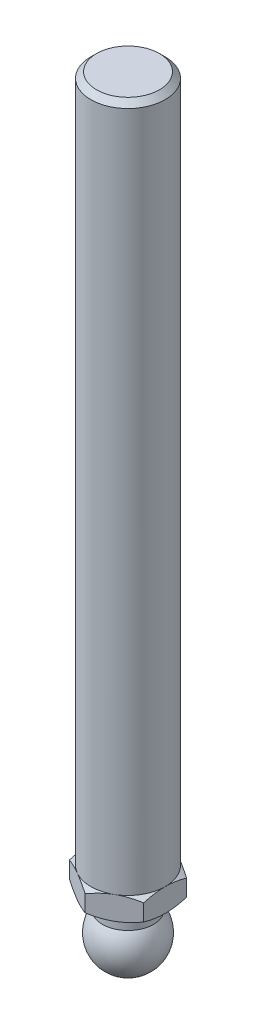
ISO-10303-21;
HEADER;
FILE_DESCRIPTION(('STEP AP214'),'2;1');
FILE_NAME('part.step','',(''),(''),'','','');
FILE_SCHEMA(('AUTOMOTIVE_DESIGN { 1 0 10303 214 1 1 1 1 }'));
ENDSEC;
DATA;
#1=APPLICATION_CONTEXT('core data for automotive mechanical design processes');
#2=APPLICATION_PROTOCOL_DEFINITION('international standard','automotive_design',2000,#1);
#3=PRODUCT_CONTEXT('',#1,'mechanical');
#4=PRODUCT('Part','Part','',(#3));
#5=PRODUCT_RELATED_PRODUCT_CATEGORY('part','',(#4));
#6=PRODUCT_DEFINITION_FORMATION('','',#4);
#7=PRODUCT_DEFINITION_CONTEXT('part definition',#1,'design');
#8=PRODUCT_DEFINITION('design','',#6,#7);
#9=PRODUCT_DEFINITION_SHAPE('','',#8);
#10=(LENGTH_UNIT() NAMED_UNIT(*) SI_UNIT(.MILLI.,.METRE.));
#11=(NAMED_UNIT(*) PLANE_ANGLE_UNIT() SI_UNIT($,.RADIAN.));
#12=(NAMED_UNIT(*) SI_UNIT($,.STERADIAN.) SOLID_ANGLE_UNIT());
#13=UNCERTAINTY_MEASURE_WITH_UNIT(LENGTH_MEASURE(1.E-05),#10,'distance_accuracy_value','');
#14=(GEOMETRIC_REPRESENTATION_CONTEXT(3) GLOBAL_UNCERTAINTY_ASSIGNED_CONTEXT((#13)) GLOBAL_UNIT_ASSIGNED_CONTEXT((#10,
#11,#12)) REPRESENTATION_CONTEXT('',''));
#15=CARTESIAN_POINT('',(0.,0.,0.));
#16=DIRECTION('',(0.,0.,1.));
#17=DIRECTION('',(1.,0.,0.));
#18=AXIS2_PLACEMENT_3D('',#15,#16,#17);
#19=CARTESIAN_POINT('',(0.,19.5,0.));
#20=DIRECTION('',(0.,-1.,0.));
#21=DIRECTION('',(0.,0.,-1.));
#22=AXIS2_PLACEMENT_3D('',#19,#20,#21);
#23=CONICAL_SURFACE('',#22,8.,1.0471975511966);
#24=CARTESIAN_POINT('',(-8.,14.714451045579,14.1889203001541));
#25=CARTESIAN_POINT('',(-8.,14.8842783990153,13.851186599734));
#26=CARTESIAN_POINT('',(-8.,15.0529801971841,13.5128811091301));
#27=CARTESIAN_POINT('',(-8.,15.3875863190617,12.8348638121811));
#28=CARTESIAN_POINT('',(-8.,15.553490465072,12.4951519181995));
#29=CARTESIAN_POINT('',(-8.,15.8822522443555,11.8134403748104));
#30=CARTESIAN_POINT('',(-8.,16.0451033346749,11.4714375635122));
#31=CARTESIAN_POINT('',(-8.,16.3666666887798,10.7854960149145));
#32=CARTESIAN_POINT('',(-8.,16.5253790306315,10.4415573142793));
#33=CARTESIAN_POINT('',(-8.,16.8449502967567,9.73535271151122));
#34=CARTESIAN_POINT('',(-8.,17.0055671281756,9.37297690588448));
#35=CARTESIAN_POINT('',(-8.,17.3197730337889,8.64516064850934));
#36=CARTESIAN_POINT('',(-8.,17.4733617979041,8.27972006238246));
#37=CARTESIAN_POINT('',(-8.,17.7714937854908,7.54540420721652));
#38=CARTESIAN_POINT('',(-8.,17.9160424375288,7.1765311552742));
#39=CARTESIAN_POINT('',(-8.,18.1936308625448,6.43449862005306));
#40=CARTESIAN_POINT('',(-8.,18.3266718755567,6.06133960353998));
#41=CARTESIAN_POINT('',(-8.,18.605819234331,5.22677195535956));
#42=CARTESIAN_POINT('',(-8.,18.7482891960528,4.76412920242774));
#43=CARTESIAN_POINT('',(-8.,19.0033463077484,3.83044032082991));
#44=CARTESIAN_POINT('',(-8.,19.115935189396,3.3593946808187));
#45=CARTESIAN_POINT('',(-8.,19.2546281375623,2.651184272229));
#46=CARTESIAN_POINT('',(-8.,19.2955954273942,2.41690742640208));
#47=CARTESIAN_POINT('',(-8.,19.3670123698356,1.94676929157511));
#48=CARTESIAN_POINT('',(-8.,19.3974635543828,1.71090823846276));
#49=CARTESIAN_POINT('',(-8.,19.4469446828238,1.23805721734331));
#50=CARTESIAN_POINT('',(-8.,19.4659782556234,1.0010676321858));
#51=CARTESIAN_POINT('',(-8.,19.4920206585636,0.526423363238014));
#52=CARTESIAN_POINT('',(-8.,19.499029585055,0.288768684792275));
#53=CARTESIAN_POINT('',(-8.,19.5007883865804,-0.188309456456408));
#54=CARTESIAN_POINT('',(-8.,19.4954490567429,-0.427733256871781));
#55=CARTESIAN_POINT('',(-8.,19.4725128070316,-0.905988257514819));
#56=CARTESIAN_POINT('',(-8.,19.4549157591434,-1.14481945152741));
#57=CARTESIAN_POINT('',(-8.,19.4080408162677,-1.62141631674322));
#58=CARTESIAN_POINT('',(-8.,19.3787584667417,-1.85918154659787));
#59=CARTESIAN_POINT('',(-8.,19.3094074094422,-2.33311174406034));
#60=CARTESIAN_POINT('',(-8.,19.2693385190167,-2.56927668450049));
#61=CARTESIAN_POINT('',(-8.,19.1329562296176,-3.28330816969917));
#62=CARTESIAN_POINT('',(-8.,19.0213579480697,-3.75830022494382));
#63=CARTESIAN_POINT('',(-8.,18.830875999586,-4.46428489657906));
#64=CARTESIAN_POINT('',(-8.,18.7635265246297,-4.69855285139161));
#65=CARTESIAN_POINT('',(-8.,18.6221775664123,-5.16507806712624));
#66=CARTESIAN_POINT('',(-8.,18.5481783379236,-5.39733540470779));
#67=CARTESIAN_POINT('',(-8.,18.3456232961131,-6.00705809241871));
#68=CARTESIAN_POINT('',(-8.,18.2123002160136,-6.38293491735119));
#69=CARTESIAN_POINT('',(-8.,17.9338794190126,-7.13030495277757));
#70=CARTESIAN_POINT('',(-8.,17.7887803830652,-7.50179766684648));
#71=CARTESIAN_POINT('',(-8.,17.4893388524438,-8.24128843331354));
#72=CARTESIAN_POINT('',(-8.,17.3349906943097,-8.60928418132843));
#73=CARTESIAN_POINT('',(-8.,17.0191219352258,-9.34215095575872));
#74=CARTESIAN_POINT('',(-8.,16.8576016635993,-9.70702212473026));
#75=CARTESIAN_POINT('',(-8.,16.5362228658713,-10.4179250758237));
#76=CARTESIAN_POINT('',(-8.,16.3766130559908,-10.7640696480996));
#77=CARTESIAN_POINT('',(-8.,16.0531867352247,-11.4543922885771));
#78=CARTESIAN_POINT('',(-8.,15.8893701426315,-11.798570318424));
#79=CARTESIAN_POINT('',(-8.,15.558638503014,-12.4845836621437));
#80=CARTESIAN_POINT('',(-8.,15.3917303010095,-12.8264222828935));
#81=CARTESIAN_POINT('',(-8.,15.0550779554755,-13.5086735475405));
#82=CARTESIAN_POINT('',(-8.,14.8853339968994,-13.8490862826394));
#83=CARTESIAN_POINT('',(-8.,14.714451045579,-14.1889203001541));
#84=B_SPLINE_CURVE_WITH_KNOTS('',3,(#24,#25,#26,#27,#28,#29,#30,#31,#32,#33,#34,#35,#36,#37,#38,
#39,#40,#41,#42,#43,#44,#45,#46,#47,#48,#49,#50,#51,#52,#53,#54,#55,#56,#57,#58,#59,#60,#61,#62,
#63,#64,#65,#66,#67,#68,#69,#70,#71,#72,#73,#74,#75,#76,#77,#78,#79,#80,#81,#82,#83),
.UNSPECIFIED.,.F.,.F.,(4,2,2,2,2,2,2,2,2,2,2,2,2,2,2,2,2,2,2,2,2,2,2,2,2,2,2,2,2,4),(0.,
1.13409047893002,2.26825272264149,3.40461779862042,4.5409614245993,5.73003075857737,
6.91915250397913,8.10755318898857,9.29582565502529,10.7473798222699,12.1988498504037,
12.9121466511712,13.6253394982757,14.3383055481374,15.0512658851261,15.7693927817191,
16.487527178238,17.2059355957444,17.9243561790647,19.38648697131,20.1177019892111,
20.8488890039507,22.0450800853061,23.2414053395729,24.4384707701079,25.6354812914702,
26.7789606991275,27.9224623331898,29.063679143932,30.2048218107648),.UNSPECIFIED.);
#85=CARTESIAN_POINT('',(-8.,18.7854688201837,4.61880215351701));
#86=VERTEX_POINT('',#85);
#87=CARTESIAN_POINT('',(-8.,19.5,0.));
#88=VERTEX_POINT('',#87);
#89=EDGE_CURVE('E310',#86,#88,#84,.T.);
#90=ORIENTED_EDGE('',*,*,#89,.F.);
#91=CARTESIAN_POINT('',(0.0002,18.7854021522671,9.23771977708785));
#92=CARTESIAN_POINT('',(-0.175648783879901,18.8440092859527,9.13619343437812));
#93=CARTESIAN_POINT('',(-0.352153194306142,18.8999565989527,9.03428856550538));
#94=CARTESIAN_POINT('',(-0.706595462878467,19.0057989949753,8.82965122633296));
#95=CARTESIAN_POINT('',(-0.884533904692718,19.0556914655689,8.72691841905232));
#96=CARTESIAN_POINT('',(-1.42119823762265,19.1953072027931,8.41707512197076));
#97=CARTESIAN_POINT('',(-1.78204258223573,19.2747188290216,8.20874154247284));
#98=CARTESIAN_POINT('',(-2.32203917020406,19.3678383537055,7.89697436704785));
#99=CARTESIAN_POINT('',(-2.49957818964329,19.3943654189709,7.79447216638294));
#100=CARTESIAN_POINT('',(-2.85545911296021,19.4388468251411,7.58900421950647));
#101=CARTESIAN_POINT('',(-3.03380094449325,19.4568019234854,7.4860385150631));
#102=CARTESIAN_POINT('',(-3.3907916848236,19.4836843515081,7.27992981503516));
#103=CARTESIAN_POINT('',(-3.56944001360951,19.4926219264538,7.17678715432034));
#104=CARTESIAN_POINT('',(-3.92690170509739,19.5012776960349,6.97040655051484));
#105=CARTESIAN_POINT('',(-4.10571506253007,19.5009961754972,6.86716861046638));
#106=CARTESIAN_POINT('',(-4.44001336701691,19.4918549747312,6.67416139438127));
#107=CARTESIAN_POINT('',(-4.59552190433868,19.4841103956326,6.58437849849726));
#108=CARTESIAN_POINT('',(-4.90617476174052,19.4617988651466,6.40502298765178));
#109=CARTESIAN_POINT('',(-5.06131905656,19.4472314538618,6.31545038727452));
#110=CARTESIAN_POINT('',(-5.52615131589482,19.3936393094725,6.04707935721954));
#111=CARTESIAN_POINT('',(-5.83501648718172,19.3447313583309,5.86875596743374));
#112=CARTESIAN_POINT('',(-6.4560232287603,19.2224605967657,5.51021755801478));
#113=CARTESIAN_POINT('',(-6.76808554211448,19.148579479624,5.33004829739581));
#114=CARTESIAN_POINT('',(-7.38755648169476,18.980899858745,4.97239658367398));
#115=CARTESIAN_POINT('',(-7.69497304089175,18.8871407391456,4.79490955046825));
#116=CARTESIAN_POINT('',(-8.0002,18.7854021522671,4.61868668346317));
#117=B_SPLINE_CURVE_WITH_KNOTS('',3,(#91,#92,#93,#94,#95,#96,#97,#98,#99,#100,#101,#102,#103,
#104,#105,#106,#107,#108,#109,#110,#111,#112,#113,#114,#115,#116),.UNSPECIFIED.,.F.,.F.,(4,2,2,
2,2,2,2,2,2,2,2,2,4),(0.,0.633973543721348,1.26821965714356,2.53934712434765,3.15934343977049,
3.77928496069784,4.39852133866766,5.01773858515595,5.55680239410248,6.09590254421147,
7.17487077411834,8.27776850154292,9.37850115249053),.UNSPECIFIED.);
#118=CARTESIAN_POINT('',(-4.,19.5,6.92820323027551));
#119=VERTEX_POINT('',#118);
#120=EDGE_CURVE('E135',#119,#86,#117,.T.);
#121=ORIENTED_EDGE('',*,*,#120,.F.);
#122=CARTESIAN_POINT('',(0.,19.5,0.));
#123=DIRECTION('',(0.,-1.,0.));
#124=DIRECTION('',(0.,0.,-1.));
#125=AXIS2_PLACEMENT_3D('',#122,#123,#124);
#126=CIRCLE('',#125,8.);
#127=EDGE_CURVE('E283',#119,#88,#126,.T.);
#128=ORIENTED_EDGE('',*,*,#127,.T.);
#129=EDGE_LOOP('',(#90,#121,#128));
#130=FACE_BOUND('',#129,.T.);
#131=ADVANCED_FACE('F14',(#130),#23,.T.);
#132=CARTESIAN_POINT('',(-8.,18.7854688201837,-4.61880215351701));
#133=VERTEX_POINT('',#132);
#134=EDGE_CURVE('E193',#88,#133,#84,.T.);
#135=ORIENTED_EDGE('',*,*,#134,.F.);
#136=CARTESIAN_POINT('',(-4.,19.5,-6.92820323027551));
#137=VERTEX_POINT('',#136);
#138=EDGE_CURVE('E195',#88,#137,#126,.T.);
#139=ORIENTED_EDGE('',*,*,#138,.T.);
#140=CARTESIAN_POINT('',(-8.0002,18.7854021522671,-4.61868668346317));
#141=CARTESIAN_POINT('',(-7.8243512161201,18.8440092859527,-4.7202130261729));
#142=CARTESIAN_POINT('',(-7.64784680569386,18.8999565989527,-4.82211789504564));
#143=CARTESIAN_POINT('',(-7.29340453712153,19.0057989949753,-5.02675523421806));
#144=CARTESIAN_POINT('',(-7.11546609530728,19.0556914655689,-5.1294880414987));
#145=CARTESIAN_POINT('',(-6.57880176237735,19.1953072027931,-5.43933133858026));
#146=CARTESIAN_POINT('',(-6.21795741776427,19.2747188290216,-5.64766491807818));
#147=CARTESIAN_POINT('',(-5.67796082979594,19.3678383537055,-5.95943209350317));
#148=CARTESIAN_POINT('',(-5.50042181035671,19.3943654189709,-6.06193429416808));
#149=CARTESIAN_POINT('',(-5.14454088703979,19.4388468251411,-6.26740224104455));
#150=CARTESIAN_POINT('',(-4.96619905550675,19.4568019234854,-6.37036794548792));
#151=CARTESIAN_POINT('',(-4.6092083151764,19.4836843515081,-6.57647664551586));
#152=CARTESIAN_POINT('',(-4.43055998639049,19.4926219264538,-6.67961930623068));
#153=CARTESIAN_POINT('',(-4.07309829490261,19.5012776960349,-6.88599991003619));
#154=CARTESIAN_POINT('',(-3.89428493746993,19.5009961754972,-6.98923785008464));
#155=CARTESIAN_POINT('',(-3.55998663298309,19.4918549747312,-7.18224506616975));
#156=CARTESIAN_POINT('',(-3.40447809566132,19.4841103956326,-7.27202796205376));
#157=CARTESIAN_POINT('',(-3.09382523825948,19.4617988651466,-7.45138347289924));
#158=CARTESIAN_POINT('',(-2.93868094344,19.4472314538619,-7.54095607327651));
#159=CARTESIAN_POINT('',(-2.47384868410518,19.3936393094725,-7.80932710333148));
#160=CARTESIAN_POINT('',(-2.16498351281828,19.3447313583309,-7.98765049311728));
#161=CARTESIAN_POINT('',(-1.5439767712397,19.2224605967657,-8.34618890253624));
#162=CARTESIAN_POINT('',(-1.23191445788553,19.148579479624,-8.52635816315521));
#163=CARTESIAN_POINT('',(-0.612443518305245,18.980899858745,-8.88400987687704));
#164=CARTESIAN_POINT('',(-0.305026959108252,18.8871407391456,-9.06149691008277));
#165=CARTESIAN_POINT('',(0.000199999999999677,18.7854021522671,-9.23771977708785));
#166=B_SPLINE_CURVE_WITH_KNOTS('',3,(#140,#141,#142,#143,#144,#145,#146,#147,#148,#149,#150,
#151,#152,#153,#154,#155,#156,#157,#158,#159,#160,#161,#162,#163,#164,#165),.UNSPECIFIED.,.F.,
.F.,(4,2,2,2,2,2,2,2,2,2,2,2,4),(0.,0.633973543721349,1.26821965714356,2.53934712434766,
3.15934343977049,3.77928496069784,4.39852133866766,5.01773858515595,5.55680239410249,
6.09590254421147,7.17487077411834,8.27776850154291,9.37850115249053),.UNSPECIFIED.);
#167=EDGE_CURVE('E183',#133,#137,#166,.T.);
#168=ORIENTED_EDGE('',*,*,#167,.F.);
#169=EDGE_LOOP('',(#135,#139,#168));
#170=FACE_BOUND('',#169,.T.);
#171=ADVANCED_FACE('F192',(#170),#23,.T.);
#172=CARTESIAN_POINT('',(0.,18.7854688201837,-9.23760430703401));
#173=VERTEX_POINT('',#172);
#174=EDGE_CURVE('E197',#137,#173,#166,.T.);
#175=ORIENTED_EDGE('',*,*,#174,.F.);
#176=CARTESIAN_POINT('',(4.,19.5,-6.92820323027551));
#177=VERTEX_POINT('',#176);
#178=EDGE_CURVE('E290',#137,#177,#126,.T.);
#179=ORIENTED_EDGE('',*,*,#178,.T.);
#180=CARTESIAN_POINT('',(-0.0002,18.7854021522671,-9.23771977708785));
#181=CARTESIAN_POINT('',(0.175648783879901,18.8440092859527,-9.13619343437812));
#182=CARTESIAN_POINT('',(0.352153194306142,18.8999565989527,-9.03428856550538));
#183=CARTESIAN_POINT('',(0.706595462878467,19.0057989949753,-8.82965122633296));
#184=CARTESIAN_POINT('',(0.884533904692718,19.0556914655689,-8.72691841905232));
#185=CARTESIAN_POINT('',(1.42119823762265,19.1953072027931,-8.41707512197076));
#186=CARTESIAN_POINT('',(1.78204258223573,19.2747188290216,-8.20874154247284));
#187=CARTESIAN_POINT('',(2.32203917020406,19.3678383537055,-7.89697436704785));
#188=CARTESIAN_POINT('',(2.49957818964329,19.3943654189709,-7.79447216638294));
#189=CARTESIAN_POINT('',(2.85545911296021,19.4388468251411,-7.58900421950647));
#190=CARTESIAN_POINT('',(3.03380094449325,19.4568019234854,-7.4860385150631));
#191=CARTESIAN_POINT('',(3.3907916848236,19.4836843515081,-7.27992981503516));
#192=CARTESIAN_POINT('',(3.56944001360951,19.4926219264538,-7.17678715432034));
#193=CARTESIAN_POINT('',(3.92690170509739,19.5012776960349,-6.97040655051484));
#194=CARTESIAN_POINT('',(4.10571506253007,19.5009961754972,-6.86716861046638));
#195=CARTESIAN_POINT('',(4.44001336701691,19.4918549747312,-6.67416139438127));
#196=CARTESIAN_POINT('',(4.59552190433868,19.4841103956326,-6.58437849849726));
#197=CARTESIAN_POINT('',(4.90617476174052,19.4617988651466,-6.40502298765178));
#198=CARTESIAN_POINT('',(5.06131905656,19.4472314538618,-6.31545038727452));
#199=CARTESIAN_POINT('',(5.52615131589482,19.3936393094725,-6.04707935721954));
#200=CARTESIAN_POINT('',(5.83501648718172,19.3447313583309,-5.86875596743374));
#201=CARTESIAN_POINT('',(6.4560232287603,19.2224605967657,-5.51021755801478));
#202=CARTESIAN_POINT('',(6.76808554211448,19.148579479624,-5.33004829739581));
#203=CARTESIAN_POINT('',(7.38755648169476,18.980899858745,-4.97239658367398));
#204=CARTESIAN_POINT('',(7.69497304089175,18.8871407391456,-4.79490955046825));
#205=CARTESIAN_POINT('',(8.0002,18.7854021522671,-4.61868668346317));
#206=B_SPLINE_CURVE_WITH_KNOTS('',3,(#180,#181,#182,#183,#184,#185,#186,#187,#188,#189,#190,
#191,#192,#193,#194,#195,#196,#197,#198,#199,#200,#201,#202,#203,#204,#205),.UNSPECIFIED.,.F.,
.F.,(4,2,2,2,2,2,2,2,2,2,2,2,4),(0.,0.633973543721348,1.26821965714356,2.53934712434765,
3.15934343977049,3.77928496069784,4.39852133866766,5.01773858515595,5.55680239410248,
6.09590254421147,7.17487077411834,8.27776850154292,9.37850115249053),.UNSPECIFIED.);
#207=EDGE_CURVE('E243',#173,#177,#206,.T.);
#208=ORIENTED_EDGE('',*,*,#207,.F.);
#209=EDGE_LOOP('',(#175,#179,#208));
#210=FACE_BOUND('',#209,.T.);
#211=ADVANCED_FACE('F342',(#210),#23,.T.);
#212=CARTESIAN_POINT('',(8.,18.7854688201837,-4.61880215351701));
#213=VERTEX_POINT('',#212);
#214=EDGE_CURVE('E238',#177,#213,#206,.T.);
#215=ORIENTED_EDGE('',*,*,#214,.F.);
#216=CARTESIAN_POINT('',(8.,19.5,0.));
#217=VERTEX_POINT('',#216);
#218=EDGE_CURVE('E287',#177,#217,#126,.T.);
#219=ORIENTED_EDGE('',*,*,#218,.T.);
#220=CARTESIAN_POINT('',(8.,14.714451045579,-14.1889203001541));
#221=CARTESIAN_POINT('',(8.,14.8842783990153,-13.851186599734));
#222=CARTESIAN_POINT('',(8.,15.0529801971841,-13.5128811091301));
#223=CARTESIAN_POINT('',(8.,15.3875863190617,-12.8348638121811));
#224=CARTESIAN_POINT('',(8.,15.553490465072,-12.4951519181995));
#225=CARTESIAN_POINT('',(8.,15.8822522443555,-11.8134403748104));
#226=CARTESIAN_POINT('',(8.,16.0451033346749,-11.4714375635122));
#227=CARTESIAN_POINT('',(8.,16.3666666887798,-10.7854960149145));
#228=CARTESIAN_POINT('',(8.,16.5253790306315,-10.4415573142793));
#229=CARTESIAN_POINT('',(8.,16.8449502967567,-9.73535271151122));
#230=CARTESIAN_POINT('',(8.,17.0055671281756,-9.37297690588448));
#231=CARTESIAN_POINT('',(8.,17.3197730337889,-8.64516064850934));
#232=CARTESIAN_POINT('',(8.,17.4733617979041,-8.27972006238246));
#233=CARTESIAN_POINT('',(8.,17.7714937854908,-7.54540420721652));
#234=CARTESIAN_POINT('',(8.,17.9160424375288,-7.1765311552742));
#235=CARTESIAN_POINT('',(8.,18.1936308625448,-6.43449862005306));
#236=CARTESIAN_POINT('',(8.,18.3266718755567,-6.06133960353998));
#237=CARTESIAN_POINT('',(8.,18.605819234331,-5.22677195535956));
#238=CARTESIAN_POINT('',(8.,18.7482891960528,-4.76412920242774));
#239=CARTESIAN_POINT('',(8.,19.0033463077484,-3.83044032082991));
#240=CARTESIAN_POINT('',(8.,19.115935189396,-3.3593946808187));
#241=CARTESIAN_POINT('',(8.,19.2546281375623,-2.651184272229));
#242=CARTESIAN_POINT('',(8.,19.2955954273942,-2.41690742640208));
#243=CARTESIAN_POINT('',(8.,19.3670123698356,-1.94676929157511));
#244=CARTESIAN_POINT('',(8.,19.3974635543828,-1.71090823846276));
#245=CARTESIAN_POINT('',(8.,19.4469446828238,-1.23805721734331));
#246=CARTESIAN_POINT('',(8.,19.4659782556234,-1.0010676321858));
#247=CARTESIAN_POINT('',(8.,19.4920206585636,-0.526423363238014));
#248=CARTESIAN_POINT('',(8.,19.499029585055,-0.288768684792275));
#249=CARTESIAN_POINT('',(8.,19.5007883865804,0.188309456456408));
#250=CARTESIAN_POINT('',(8.,19.4954490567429,0.427733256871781));
#251=CARTESIAN_POINT('',(8.,19.4725128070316,0.905988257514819));
#252=CARTESIAN_POINT('',(8.,19.4549157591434,1.14481945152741));
#253=CARTESIAN_POINT('',(8.,19.4080408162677,1.62141631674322));
#254=CARTESIAN_POINT('',(8.,19.3787584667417,1.85918154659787));
#255=CARTESIAN_POINT('',(8.,19.3094074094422,2.33311174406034));
#256=CARTESIAN_POINT('',(8.,19.2693385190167,2.56927668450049));
#257=CARTESIAN_POINT('',(8.,19.1329562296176,3.28330816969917));
#258=CARTESIAN_POINT('',(8.,19.0213579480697,3.75830022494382));
#259=CARTESIAN_POINT('',(8.,18.830875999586,4.46428489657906));
#260=CARTESIAN_POINT('',(8.,18.7635265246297,4.69855285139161));
#261=CARTESIAN_POINT('',(8.,18.6221775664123,5.16507806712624));
#262=CARTESIAN_POINT('',(8.,18.5481783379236,5.39733540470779));
#263=CARTESIAN_POINT('',(8.,18.3456232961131,6.00705809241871));
#264=CARTESIAN_POINT('',(8.,18.2123002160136,6.38293491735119));
#265=CARTESIAN_POINT('',(8.,17.9338794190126,7.13030495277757));
#266=CARTESIAN_POINT('',(8.,17.7887803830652,7.50179766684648));
#267=CARTESIAN_POINT('',(8.,17.4893388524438,8.24128843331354));
#268=CARTESIAN_POINT('',(8.,17.3349906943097,8.60928418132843));
#269=CARTESIAN_POINT('',(8.,17.0191219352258,9.34215095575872));
#270=CARTESIAN_POINT('',(8.,16.8576016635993,9.70702212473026));
#271=CARTESIAN_POINT('',(8.,16.5362228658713,10.4179250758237));
#272=CARTESIAN_POINT('',(8.,16.3766130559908,10.7640696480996));
#273=CARTESIAN_POINT('',(8.,16.0531867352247,11.4543922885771));
#274=CARTESIAN_POINT('',(8.,15.8893701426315,11.798570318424));
#275=CARTESIAN_POINT('',(8.,15.558638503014,12.4845836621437));
#276=CARTESIAN_POINT('',(8.,15.3917303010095,12.8264222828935));
#277=CARTESIAN_POINT('',(8.,15.0550779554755,13.5086735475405));
#278=CARTESIAN_POINT('',(8.,14.8853339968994,13.8490862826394));
#279=CARTESIAN_POINT('',(8.,14.714451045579,14.1889203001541));
#280=B_SPLINE_CURVE_WITH_KNOTS('',3,(#220,#221,#222,#223,#224,#225,#226,#227,#228,#229,#230,
#231,#232,#233,#234,#235,#236,#237,#238,#239,#240,#241,#242,#243,#244,#245,#246,#247,#248,#249,
#250,#251,#252,#253,#254,#255,#256,#257,#258,#259,#260,#261,#262,#263,#264,#265,#266,#267,#268,
#269,#270,#271,#272,#273,#274,#275,#276,#277,#278,#279),.UNSPECIFIED.,.F.,.F.,(4,2,2,2,2,2,2,2,
2,2,2,2,2,2,2,2,2,2,2,2,2,2,2,2,2,2,2,2,2,4),(0.,1.13409047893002,2.26825272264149,
3.40461779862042,4.5409614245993,5.73003075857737,6.91915250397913,8.10755318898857,
9.29582565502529,10.7473798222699,12.1988498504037,12.9121466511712,13.6253394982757,
14.3383055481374,15.0512658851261,15.7693927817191,16.487527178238,17.2059355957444,
17.9243561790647,19.38648697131,20.1177019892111,20.8488890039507,22.0450800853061,
23.2414053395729,24.4384707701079,25.6354812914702,26.7789606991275,27.9224623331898,
29.063679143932,30.2048218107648),.UNSPECIFIED.);
#281=EDGE_CURVE('E249',#213,#217,#280,.T.);
#282=ORIENTED_EDGE('',*,*,#281,.F.);
#283=EDGE_LOOP('',(#215,#219,#282));
#284=FACE_BOUND('',#283,.T.);
#285=ADVANCED_FACE('F352',(#284),#23,.T.);
#286=CARTESIAN_POINT('',(8.,18.7854688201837,4.61880215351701));
#287=VERTEX_POINT('',#286);
#288=EDGE_CURVE('E251',#217,#287,#280,.T.);
#289=ORIENTED_EDGE('',*,*,#288,.F.);
#290=CARTESIAN_POINT('',(4.,19.5,6.92820323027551));
#291=VERTEX_POINT('',#290);
#292=EDGE_CURVE('E281',#217,#291,#126,.T.);
#293=ORIENTED_EDGE('',*,*,#292,.T.);
#294=CARTESIAN_POINT('',(8.0002,18.7854021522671,4.61868668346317));
#295=CARTESIAN_POINT('',(7.8243512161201,18.8440092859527,4.7202130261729));
#296=CARTESIAN_POINT('',(7.64784680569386,18.8999565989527,4.82211789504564));
#297=CARTESIAN_POINT('',(7.29340453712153,19.0057989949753,5.02675523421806));
#298=CARTESIAN_POINT('',(7.11546609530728,19.0556914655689,5.1294880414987));
#299=CARTESIAN_POINT('',(6.57880176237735,19.1953072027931,5.43933133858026));
#300=CARTESIAN_POINT('',(6.21795741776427,19.2747188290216,5.64766491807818));
#301=CARTESIAN_POINT('',(5.67796082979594,19.3678383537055,5.95943209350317));
#302=CARTESIAN_POINT('',(5.50042181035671,19.3943654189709,6.06193429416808));
#303=CARTESIAN_POINT('',(5.14454088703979,19.4388468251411,6.26740224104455));
#304=CARTESIAN_POINT('',(4.96619905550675,19.4568019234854,6.37036794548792));
#305=CARTESIAN_POINT('',(4.6092083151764,19.4836843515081,6.57647664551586));
#306=CARTESIAN_POINT('',(4.43055998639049,19.4926219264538,6.67961930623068));
#307=CARTESIAN_POINT('',(4.07309829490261,19.5012776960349,6.88599991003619));
#308=CARTESIAN_POINT('',(3.89428493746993,19.5009961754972,6.98923785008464));
#309=CARTESIAN_POINT('',(3.55998663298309,19.4918549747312,7.18224506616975));
#310=CARTESIAN_POINT('',(3.40447809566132,19.4841103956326,7.27202796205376));
#311=CARTESIAN_POINT('',(3.09382523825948,19.4617988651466,7.45138347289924));
#312=CARTESIAN_POINT('',(2.93868094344,19.4472314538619,7.54095607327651));
#313=CARTESIAN_POINT('',(2.47384868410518,19.3936393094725,7.80932710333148));
#314=CARTESIAN_POINT('',(2.16498351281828,19.3447313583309,7.98765049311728));
#315=CARTESIAN_POINT('',(1.5439767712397,19.2224605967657,8.34618890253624));
#316=CARTESIAN_POINT('',(1.23191445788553,19.148579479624,8.52635816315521));
#317=CARTESIAN_POINT('',(0.612443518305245,18.980899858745,8.88400987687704));
#318=CARTESIAN_POINT('',(0.305026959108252,18.8871407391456,9.06149691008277));
#319=CARTESIAN_POINT('',(-0.000199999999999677,18.7854021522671,9.23771977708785));
#320=B_SPLINE_CURVE_WITH_KNOTS('',3,(#294,#295,#296,#297,#298,#299,#300,#301,#302,#303,#304,
#305,#306,#307,#308,#309,#310,#311,#312,#313,#314,#315,#316,#317,#318,#319),.UNSPECIFIED.,.F.,
.F.,(4,2,2,2,2,2,2,2,2,2,2,2,4),(0.,0.633973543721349,1.26821965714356,2.53934712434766,
3.15934343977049,3.77928496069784,4.39852133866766,5.01773858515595,5.55680239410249,
6.09590254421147,7.17487077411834,8.27776850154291,9.37850115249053),.UNSPECIFIED.);
#321=EDGE_CURVE('E126',#287,#291,#320,.T.);
#322=ORIENTED_EDGE('',*,*,#321,.F.);
#323=EDGE_LOOP('',(#289,#293,#322));
#324=FACE_BOUND('',#323,.T.);
#325=ADVANCED_FACE('F285',(#324),#23,.T.);
#326=CARTESIAN_POINT('',(0.,18.7854688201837,9.23760430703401));
#327=VERTEX_POINT('',#326);
#328=EDGE_CURVE('E116',#291,#327,#320,.T.);
#329=ORIENTED_EDGE('',*,*,#328,.F.);
#330=EDGE_CURVE('E274',#291,#119,#126,.T.);
#331=ORIENTED_EDGE('',*,*,#330,.T.);
#332=EDGE_CURVE('E29',#327,#119,#117,.T.);
#333=ORIENTED_EDGE('',*,*,#332,.F.);
#334=EDGE_LOOP('',(#329,#331,#333));
#335=FACE_BOUND('',#334,.T.);
#336=ADVANCED_FACE('F273',(#335),#23,.T.);
#337=CARTESIAN_POINT('',(0.,167.5,0.));
#338=DIRECTION('',(0.,-1.,0.));
#339=DIRECTION('',(0.,0.,-1.));
#340=AXIS2_PLACEMENT_3D('',#337,#338,#339);
#341=PLANE('',#340);
#342=CARTESIAN_POINT('',(0.,167.5,0.));
#343=DIRECTION('',(0.,-1.,0.));
#344=DIRECTION('',(0.,0.,-1.));
#345=AXIS2_PLACEMENT_3D('',#342,#343,#344);
#346=CIRCLE('',#345,6.773);
#347=CARTESIAN_POINT('',(0.,167.5,-6.773));
#348=VERTEX_POINT('',#347);
#349=EDGE_CURVE('E9',#348,#348,#346,.T.);
#350=ORIENTED_EDGE('',*,*,#349,.F.);
#351=EDGE_LOOP('',(#350));
#352=FACE_BOUND('',#351,.T.);
#353=ADVANCED_FACE('F16',(#352),#341,.F.);
#354=CARTESIAN_POINT('',(0.,167.5,0.));
#355=DIRECTION('',(0.,-1.,0.));
#356=DIRECTION('',(0.,0.,-1.));
#357=AXIS2_PLACEMENT_3D('',#354,#355,#356);
#358=CONICAL_SURFACE('',#357,6.773,0.785398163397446);
#359=CARTESIAN_POINT('',(0.,166.273,0.));
#360=DIRECTION('',(0.,-1.,0.));
#361=DIRECTION('',(0.,0.,-1.));
#362=AXIS2_PLACEMENT_3D('',#359,#360,#361);
#363=CIRCLE('',#362,8.);
#364=CARTESIAN_POINT('',(0.,166.273,-8.));
#365=VERTEX_POINT('',#364);
#366=EDGE_CURVE('E22',#365,#365,#363,.T.);
#367=ORIENTED_EDGE('',*,*,#366,.F.);
#368=EDGE_LOOP('',(#367));
#369=FACE_BOUND('',#368,.T.);
#370=ORIENTED_EDGE('',*,*,#349,.T.);
#371=EDGE_LOOP('',(#370));
#372=FACE_BOUND('',#371,.T.);
#373=ADVANCED_FACE('F350',(#369,#372),#358,.T.);
#374=CARTESIAN_POINT('',(0.,0.,0.));
#375=DIRECTION('',(0.,-1.,0.));
#376=DIRECTION('',(0.,0.,-1.));
#377=AXIS2_PLACEMENT_3D('',#374,#375,#376);
#378=CYLINDRICAL_SURFACE('',#377,8.);
#379=ORIENTED_EDGE('',*,*,#292,.F.);
#380=ORIENTED_EDGE('',*,*,#218,.F.);
#381=ORIENTED_EDGE('',*,*,#178,.F.);
#382=ORIENTED_EDGE('',*,*,#138,.F.);
#383=ORIENTED_EDGE('',*,*,#127,.F.);
#384=ORIENTED_EDGE('',*,*,#330,.F.);
#385=EDGE_LOOP('',(#379,#380,#381,#382,#383,#384));
#386=FACE_BOUND('',#385,.T.);
#387=ORIENTED_EDGE('',*,*,#366,.T.);
#388=EDGE_LOOP('',(#387));
#389=FACE_BOUND('',#388,.T.);
#390=ADVANCED_FACE('F278',(#386,#389),#378,.T.);
#391=CARTESIAN_POINT('',(-8.,14.3,-4.61880215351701));
#392=DIRECTION('',(-1.,0.,0.));
#393=DIRECTION('',(0.,0.,1.));
#394=AXIS2_PLACEMENT_3D('',#391,#392,#393);
#395=PLANE('',#394);
#396=ORIENTED_EDGE('',*,*,#89,.T.);
#397=ORIENTED_EDGE('',*,*,#134,.T.);
#398=DIRECTION('',(0.,1.,0.));
#399=VECTOR('',#398,1.);
#400=CARTESIAN_POINT('',(-8.,14.3,-4.61880215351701));
#401=LINE('',#400,#399);
#402=CARTESIAN_POINT('',(-8.,15.2145311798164,-4.61880215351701));
#403=VERTEX_POINT('',#402);
#404=EDGE_CURVE('E109',#403,#133,#401,.T.);
#405=ORIENTED_EDGE('',*,*,#404,.F.);
#406=CARTESIAN_POINT('',(-8.,19.285548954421,-14.1889203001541));
#407=CARTESIAN_POINT('',(-8.,19.1157216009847,-13.851186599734));
#408=CARTESIAN_POINT('',(-8.,18.9470198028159,-13.5128811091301));
#409=CARTESIAN_POINT('',(-8.,18.6124136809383,-12.8348638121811));
#410=CARTESIAN_POINT('',(-8.,18.446509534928,-12.4951519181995));
#411=CARTESIAN_POINT('',(-8.,18.1177477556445,-11.8134403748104));
#412=CARTESIAN_POINT('',(-8.,17.9548966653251,-11.4714375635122));
#413=CARTESIAN_POINT('',(-8.,17.6333333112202,-10.7854960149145));
#414=CARTESIAN_POINT('',(-8.,17.4746209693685,-10.4415573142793));
#415=CARTESIAN_POINT('',(-8.,17.1550497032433,-9.7353527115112));
#416=CARTESIAN_POINT('',(-8.,16.9944328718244,-9.37297690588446));
#417=CARTESIAN_POINT('',(-8.,16.680226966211,-8.64516064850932));
#418=CARTESIAN_POINT('',(-8.,16.5266382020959,-8.27972006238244));
#419=CARTESIAN_POINT('',(-8.,16.2285062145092,-7.54540420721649));
#420=CARTESIAN_POINT('',(-8.,16.0839575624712,-7.17653115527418));
#421=CARTESIAN_POINT('',(-8.,15.8063691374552,-6.43449862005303));
#422=CARTESIAN_POINT('',(-8.,15.6733281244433,-6.06133960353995));
#423=CARTESIAN_POINT('',(-8.,15.394180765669,-5.22677195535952));
#424=CARTESIAN_POINT('',(-8.,15.2517108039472,-4.7641292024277));
#425=CARTESIAN_POINT('',(-8.,14.9966536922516,-3.83044032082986));
#426=CARTESIAN_POINT('',(-8.,14.884064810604,-3.35939468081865));
#427=CARTESIAN_POINT('',(-8.,14.7453718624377,-2.65118427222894));
#428=CARTESIAN_POINT('',(-8.,14.7044045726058,-2.41690742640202));
#429=CARTESIAN_POINT('',(-8.,14.6329876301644,-1.94676929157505));
#430=CARTESIAN_POINT('',(-8.,14.6025364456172,-1.7109082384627));
#431=CARTESIAN_POINT('',(-8.,14.5530553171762,-1.23805721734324));
#432=CARTESIAN_POINT('',(-8.,14.5340217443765,-1.00106763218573));
#433=CARTESIAN_POINT('',(-8.,14.5079793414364,-0.52642336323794));
#434=CARTESIAN_POINT('',(-8.,14.500970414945,-0.288768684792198));
#435=CARTESIAN_POINT('',(-8.,14.4992116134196,0.188309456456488));
#436=CARTESIAN_POINT('',(-8.,14.5045509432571,0.427733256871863));
#437=CARTESIAN_POINT('',(-8.,14.5274871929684,0.905988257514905));
#438=CARTESIAN_POINT('',(-8.,14.5450842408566,1.1448194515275));
#439=CARTESIAN_POINT('',(-8.,14.5919591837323,1.62141631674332));
#440=CARTESIAN_POINT('',(-8.,14.6212415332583,1.85918154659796));
#441=CARTESIAN_POINT('',(-8.,14.6905925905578,2.33311174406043));
#442=CARTESIAN_POINT('',(-8.,14.7306614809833,2.56927668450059));
#443=CARTESIAN_POINT('',(-8.,14.8670437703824,3.28330816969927));
#444=CARTESIAN_POINT('',(-8.,14.9786420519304,3.75830022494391));
#445=CARTESIAN_POINT('',(-8.,15.169124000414,4.46428489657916));
#446=CARTESIAN_POINT('',(-8.,15.2364734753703,4.69855285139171));
#447=CARTESIAN_POINT('',(-8.,15.3778224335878,5.16507806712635));
#448=CARTESIAN_POINT('',(-8.,15.4518216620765,5.3973354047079));
#449=CARTESIAN_POINT('',(-8.,15.654376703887,6.0070580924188));
#450=CARTESIAN_POINT('',(-8.,15.7876997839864,6.38293491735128));
#451=CARTESIAN_POINT('',(-8.,16.0661205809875,7.13030495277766));
#452=CARTESIAN_POINT('',(-8.,16.2112196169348,7.50179766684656));
#453=CARTESIAN_POINT('',(-8.,16.5106611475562,8.2412884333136));
#454=CARTESIAN_POINT('',(-8.,16.6650093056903,8.60928418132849));
#455=CARTESIAN_POINT('',(-8.,16.9808780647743,9.34215095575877));
#456=CARTESIAN_POINT('',(-8.,17.1423983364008,9.7070221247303));
#457=CARTESIAN_POINT('',(-8.,17.4637771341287,10.4179250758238));
#458=CARTESIAN_POINT('',(-8.,17.6233869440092,10.7640696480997));
#459=CARTESIAN_POINT('',(-8.,17.9468132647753,11.4543922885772));
#460=CARTESIAN_POINT('',(-8.,18.1106298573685,11.7985703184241));
#461=CARTESIAN_POINT('',(-8.,18.441361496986,12.4845836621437));
#462=CARTESIAN_POINT('',(-8.,18.6082696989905,12.8264222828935));
#463=CARTESIAN_POINT('',(-8.,18.9449220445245,13.5086735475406));
#464=CARTESIAN_POINT('',(-8.,19.1146660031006,13.8490862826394));
#465=CARTESIAN_POINT('',(-8.,19.285548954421,14.1889203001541));
#466=B_SPLINE_CURVE_WITH_KNOTS('',3,(#406,#407,#408,#409,#410,#411,#412,#413,#414,#415,#416,
#417,#418,#419,#420,#421,#422,#423,#424,#425,#426,#427,#428,#429,#430,#431,#432,#433,#434,#435,
#436,#437,#438,#439,#440,#441,#442,#443,#444,#445,#446,#447,#448,#449,#450,#451,#452,#453,#454,
#455,#456,#457,#458,#459,#460,#461,#462,#463,#464,#465),.UNSPECIFIED.,.F.,.F.,(4,2,2,2,2,2,2,2,
2,2,2,2,2,2,2,2,2,2,2,2,2,2,2,2,2,2,2,2,2,4),(0.,1.13409047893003,2.2682527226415,
3.40461779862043,4.54096142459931,5.7300307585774,6.91915250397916,8.1075531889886,
9.29582565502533,10.7473798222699,12.1988498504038,12.9121466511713,13.6253394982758,
14.3383055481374,15.0512658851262,15.7693927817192,16.4875271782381,17.2059355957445,
17.9243561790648,19.3864869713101,20.1177019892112,20.8488890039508,22.0450800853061,
23.2414053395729,24.4384707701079,25.6354812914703,26.7789606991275,27.9224623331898,
29.063679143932,30.2048218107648),.UNSPECIFIED.);
#467=CARTESIAN_POINT('',(-8.,14.5,0.));
#468=VERTEX_POINT('',#467);
#469=EDGE_CURVE('E199',#403,#468,#466,.T.);
#470=ORIENTED_EDGE('',*,*,#469,.T.);
#471=CARTESIAN_POINT('',(-8.,15.2145311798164,4.61880215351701));
#472=VERTEX_POINT('',#471);
#473=EDGE_CURVE('E196',#468,#472,#466,.T.);
#474=ORIENTED_EDGE('',*,*,#473,.T.);
#475=DIRECTION('',(0.,1.,0.));
#476=VECTOR('',#475,1.);
#477=CARTESIAN_POINT('',(-8.,14.3,4.61880215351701));
#478=LINE('',#477,#476);
#479=EDGE_CURVE('E118',#472,#86,#478,.T.);
#480=ORIENTED_EDGE('',*,*,#479,.T.);
#481=EDGE_LOOP('',(#396,#397,#405,#470,#474,#480));
#482=FACE_BOUND('',#481,.T.);
#483=ADVANCED_FACE('F224',(#482),#395,.T.);
#484=CARTESIAN_POINT('',(0.,14.3,-9.23760430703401));
#485=DIRECTION('',(-0.5,0.,-0.866025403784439));
#486=DIRECTION('',(-0.866025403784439,0.,0.5));
#487=AXIS2_PLACEMENT_3D('',#484,#485,#486);
#488=PLANE('',#487);
#489=ORIENTED_EDGE('',*,*,#167,.T.);
#490=ORIENTED_EDGE('',*,*,#174,.T.);
#491=DIRECTION('',(0.,1.,0.));
#492=VECTOR('',#491,1.);
#493=CARTESIAN_POINT('',(0.,14.3,-9.23760430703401));
#494=LINE('',#493,#492);
#495=CARTESIAN_POINT('',(0.,15.2145311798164,-9.23760430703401));
#496=VERTEX_POINT('',#495);
#497=EDGE_CURVE('E175',#496,#173,#494,.T.);
#498=ORIENTED_EDGE('',*,*,#497,.F.);
#499=CARTESIAN_POINT('',(0.0002,15.214597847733,-9.23771977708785));
#500=CARTESIAN_POINT('',(-0.175648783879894,15.1559907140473,-9.13619343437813));
#501=CARTESIAN_POINT('',(-0.352153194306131,15.1000434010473,-9.03428856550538));
#502=CARTESIAN_POINT('',(-0.706595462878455,14.9942010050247,-8.82965122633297));
#503=CARTESIAN_POINT('',(-0.884533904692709,14.9443085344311,-8.72691841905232));
#504=CARTESIAN_POINT('',(-1.42119823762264,14.8046927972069,-8.41707512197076));
#505=CARTESIAN_POINT('',(-1.78204258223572,14.7252811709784,-8.20874154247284));
#506=CARTESIAN_POINT('',(-2.32203917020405,14.6321616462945,-7.89697436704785));
#507=CARTESIAN_POINT('',(-2.49957818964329,14.6056345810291,-7.79447216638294));
#508=CARTESIAN_POINT('',(-2.8554591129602,14.5611531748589,-7.58900421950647));
#509=CARTESIAN_POINT('',(-3.03380094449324,14.5431980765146,-7.4860385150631));
#510=CARTESIAN_POINT('',(-3.39079168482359,14.5163156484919,-7.27992981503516));
#511=CARTESIAN_POINT('',(-3.5694400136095,14.5073780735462,-7.17678715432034));
#512=CARTESIAN_POINT('',(-3.92690170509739,14.4987223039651,-6.97040655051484));
#513=CARTESIAN_POINT('',(-4.10571506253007,14.4990038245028,-6.86716861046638));
#514=CARTESIAN_POINT('',(-4.44001336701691,14.5081450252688,-6.67416139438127));
#515=CARTESIAN_POINT('',(-4.59552190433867,14.5158896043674,-6.58437849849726));
#516=CARTESIAN_POINT('',(-4.90617476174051,14.5382011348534,-6.40502298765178));
#517=CARTESIAN_POINT('',(-5.06131905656,14.5527685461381,-6.31545038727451));
#518=CARTESIAN_POINT('',(-5.52615131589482,14.6063606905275,-6.04707935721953));
#519=CARTESIAN_POINT('',(-5.83501648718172,14.6552686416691,-5.86875596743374));
#520=CARTESIAN_POINT('',(-6.4560232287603,14.7775394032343,-5.51021755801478));
#521=CARTESIAN_POINT('',(-6.76808554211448,14.851420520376,-5.3300482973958));
#522=CARTESIAN_POINT('',(-7.38755648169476,15.019100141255,-4.97239658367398));
#523=CARTESIAN_POINT('',(-7.69497304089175,15.1128592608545,-4.79490955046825));
#524=CARTESIAN_POINT('',(-8.0002,15.214597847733,-4.61868668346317));
#525=B_SPLINE_CURVE_WITH_KNOTS('',3,(#499,#500,#501,#502,#503,#504,#505,#506,#507,#508,#509,
#510,#511,#512,#513,#514,#515,#516,#517,#518,#519,#520,#521,#522,#523,#524),.UNSPECIFIED.,.F.,
.F.,(4,2,2,2,2,2,2,2,2,2,2,2,4),(0.,0.633973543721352,1.26821965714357,2.53934712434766,
3.1593434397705,3.77928496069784,4.39852133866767,5.01773858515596,5.5568023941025,
6.09590254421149,7.17487077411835,8.27776850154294,9.37850115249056),.UNSPECIFIED.);
#526=CARTESIAN_POINT('',(-4.,14.5,-6.92820323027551));
#527=VERTEX_POINT('',#526);
#528=EDGE_CURVE('E201',#496,#527,#525,.T.);
#529=ORIENTED_EDGE('',*,*,#528,.T.);
#530=EDGE_CURVE('E186',#527,#403,#525,.T.);
#531=ORIENTED_EDGE('',*,*,#530,.T.);
#532=ORIENTED_EDGE('',*,*,#404,.T.);
#533=EDGE_LOOP('',(#489,#490,#498,#529,#531,#532));
#534=FACE_BOUND('',#533,.T.);
#535=ADVANCED_FACE('F182',(#534),#488,.T.);
#536=CARTESIAN_POINT('',(8.,14.3,-4.61880215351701));
#537=DIRECTION('',(0.5,0.,-0.866025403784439));
#538=DIRECTION('',(-0.866025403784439,0.,-0.5));
#539=AXIS2_PLACEMENT_3D('',#536,#537,#538);
#540=PLANE('',#539);
#541=ORIENTED_EDGE('',*,*,#207,.T.);
#542=ORIENTED_EDGE('',*,*,#214,.T.);
#543=DIRECTION('',(0.,1.,0.));
#544=VECTOR('',#543,1.);
#545=CARTESIAN_POINT('',(8.,14.3,-4.61880215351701));
#546=LINE('',#545,#544);
#547=CARTESIAN_POINT('',(8.,15.2145311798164,-4.61880215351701));
#548=VERTEX_POINT('',#547);
#549=EDGE_CURVE('E172',#548,#213,#546,.T.);
#550=ORIENTED_EDGE('',*,*,#549,.F.);
#551=CARTESIAN_POINT('',(8.0002,15.214597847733,-4.61868668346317));
#552=CARTESIAN_POINT('',(7.82435121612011,15.1559907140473,-4.7202130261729));
#553=CARTESIAN_POINT('',(7.64784680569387,15.1000434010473,-4.82211789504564));
#554=CARTESIAN_POINT('',(7.29340453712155,14.9942010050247,-5.02675523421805));
#555=CARTESIAN_POINT('',(7.11546609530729,14.9443085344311,-5.1294880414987));
#556=CARTESIAN_POINT('',(6.57880176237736,14.8046927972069,-5.43933133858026));
#557=CARTESIAN_POINT('',(6.21795741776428,14.7252811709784,-5.64766491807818));
#558=CARTESIAN_POINT('',(5.67796082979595,14.6321616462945,-5.95943209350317));
#559=CARTESIAN_POINT('',(5.50042181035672,14.6056345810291,-6.06193429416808));
#560=CARTESIAN_POINT('',(5.1445408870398,14.5611531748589,-6.26740224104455));
#561=CARTESIAN_POINT('',(4.96619905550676,14.5431980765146,-6.37036794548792));
#562=CARTESIAN_POINT('',(4.60920831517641,14.5163156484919,-6.57647664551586));
#563=CARTESIAN_POINT('',(4.4305599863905,14.5073780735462,-6.67961930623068));
#564=CARTESIAN_POINT('',(4.07309829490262,14.4987223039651,-6.88599991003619));
#565=CARTESIAN_POINT('',(3.89428493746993,14.4990038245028,-6.98923785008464));
#566=CARTESIAN_POINT('',(3.55998663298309,14.5081450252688,-7.18224506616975));
#567=CARTESIAN_POINT('',(3.40447809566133,14.5158896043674,-7.27202796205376));
#568=CARTESIAN_POINT('',(3.09382523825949,14.5382011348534,-7.45138347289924));
#569=CARTESIAN_POINT('',(2.93868094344,14.5527685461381,-7.54095607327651));
#570=CARTESIAN_POINT('',(2.47384868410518,14.6063606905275,-7.80932710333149));
#571=CARTESIAN_POINT('',(2.16498351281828,14.6552686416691,-7.98765049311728));
#572=CARTESIAN_POINT('',(1.5439767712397,14.7775394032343,-8.34618890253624));
#573=CARTESIAN_POINT('',(1.23191445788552,14.851420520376,-8.52635816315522));
#574=CARTESIAN_POINT('',(0.612443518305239,15.019100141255,-8.88400987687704));
#575=CARTESIAN_POINT('',(0.305026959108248,15.1128592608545,-9.06149691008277));
#576=CARTESIAN_POINT('',(-0.000200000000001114,15.214597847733,-9.23771977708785));
#577=B_SPLINE_CURVE_WITH_KNOTS('',3,(#551,#552,#553,#554,#555,#556,#557,#558,#559,#560,#561,
#562,#563,#564,#565,#566,#567,#568,#569,#570,#571,#572,#573,#574,#575,#576),.UNSPECIFIED.,.F.,
.F.,(4,2,2,2,2,2,2,2,2,2,2,2,4),(0.,0.633973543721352,1.26821965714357,2.53934712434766,
3.1593434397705,3.77928496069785,4.39852133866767,5.01773858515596,5.5568023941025,
6.09590254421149,7.17487077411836,8.27776850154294,9.37850115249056),.UNSPECIFIED.);
#578=CARTESIAN_POINT('',(4.,14.5,-6.92820323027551));
#579=VERTEX_POINT('',#578);
#580=EDGE_CURVE('E244',#548,#579,#577,.T.);
#581=ORIENTED_EDGE('',*,*,#580,.T.);
#582=EDGE_CURVE('E232',#579,#496,#577,.T.);
#583=ORIENTED_EDGE('',*,*,#582,.T.);
#584=ORIENTED_EDGE('',*,*,#497,.T.);
#585=EDGE_LOOP('',(#541,#542,#550,#581,#583,#584));
#586=FACE_BOUND('',#585,.T.);
#587=ADVANCED_FACE('F223',(#586),#540,.T.);
#588=CARTESIAN_POINT('',(8.,14.3,4.61880215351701));
#589=DIRECTION('',(1.,0.,0.));
#590=DIRECTION('',(0.,0.,-1.));
#591=AXIS2_PLACEMENT_3D('',#588,#589,#590);
#592=PLANE('',#591);
#593=ORIENTED_EDGE('',*,*,#281,.T.);
#594=ORIENTED_EDGE('',*,*,#288,.T.);
#595=DIRECTION('',(0.,1.,0.));
#596=VECTOR('',#595,1.);
#597=CARTESIAN_POINT('',(8.,14.3,4.61880215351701));
#598=LINE('',#597,#596);
#599=CARTESIAN_POINT('',(8.,15.2145311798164,4.61880215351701));
#600=VERTEX_POINT('',#599);
#601=EDGE_CURVE('E117',#600,#287,#598,.T.);
#602=ORIENTED_EDGE('',*,*,#601,.F.);
#603=CARTESIAN_POINT('',(8.,19.285548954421,14.1889203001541));
#604=CARTESIAN_POINT('',(8.,19.1157216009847,13.851186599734));
#605=CARTESIAN_POINT('',(8.,18.9470198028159,13.5128811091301));
#606=CARTESIAN_POINT('',(8.,18.6124136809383,12.8348638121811));
#607=CARTESIAN_POINT('',(8.,18.446509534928,12.4951519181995));
#608=CARTESIAN_POINT('',(8.,18.1177477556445,11.8134403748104));
#609=CARTESIAN_POINT('',(8.,17.9548966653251,11.4714375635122));
#610=CARTESIAN_POINT('',(8.,17.6333333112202,10.7854960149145));
#611=CARTESIAN_POINT('',(8.,17.4746209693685,10.4415573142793));
#612=CARTESIAN_POINT('',(8.,17.1550497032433,9.7353527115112));
#613=CARTESIAN_POINT('',(8.,16.9944328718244,9.37297690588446));
#614=CARTESIAN_POINT('',(8.,16.680226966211,8.64516064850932));
#615=CARTESIAN_POINT('',(8.,16.5266382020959,8.27972006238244));
#616=CARTESIAN_POINT('',(8.,16.2285062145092,7.54540420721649));
#617=CARTESIAN_POINT('',(8.,16.0839575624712,7.17653115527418));
#618=CARTESIAN_POINT('',(8.,15.8063691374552,6.43449862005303));
#619=CARTESIAN_POINT('',(8.,15.6733281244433,6.06133960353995));
#620=CARTESIAN_POINT('',(8.,15.394180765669,5.22677195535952));
#621=CARTESIAN_POINT('',(8.,15.2517108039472,4.7641292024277));
#622=CARTESIAN_POINT('',(8.,14.9966536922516,3.83044032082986));
#623=CARTESIAN_POINT('',(8.,14.884064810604,3.35939468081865));
#624=CARTESIAN_POINT('',(8.,14.7453718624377,2.65118427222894));
#625=CARTESIAN_POINT('',(8.,14.7044045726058,2.41690742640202));
#626=CARTESIAN_POINT('',(8.,14.6329876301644,1.94676929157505));
#627=CARTESIAN_POINT('',(8.,14.6025364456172,1.7109082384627));
#628=CARTESIAN_POINT('',(8.,14.5530553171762,1.23805721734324));
#629=CARTESIAN_POINT('',(8.,14.5340217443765,1.00106763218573));
#630=CARTESIAN_POINT('',(8.,14.5079793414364,0.52642336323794));
#631=CARTESIAN_POINT('',(8.,14.500970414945,0.288768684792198));
#632=CARTESIAN_POINT('',(8.,14.4992116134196,-0.188309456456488));
#633=CARTESIAN_POINT('',(8.,14.5045509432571,-0.427733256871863));
#634=CARTESIAN_POINT('',(8.,14.5274871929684,-0.905988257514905));
#635=CARTESIAN_POINT('',(8.,14.5450842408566,-1.1448194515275));
#636=CARTESIAN_POINT('',(8.,14.5919591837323,-1.62141631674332));
#637=CARTESIAN_POINT('',(8.,14.6212415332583,-1.85918154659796));
#638=CARTESIAN_POINT('',(8.,14.6905925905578,-2.33311174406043));
#639=CARTESIAN_POINT('',(8.,14.7306614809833,-2.56927668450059));
#640=CARTESIAN_POINT('',(8.,14.8670437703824,-3.28330816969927));
#641=CARTESIAN_POINT('',(8.,14.9786420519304,-3.75830022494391));
#642=CARTESIAN_POINT('',(8.,15.169124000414,-4.46428489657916));
#643=CARTESIAN_POINT('',(8.,15.2364734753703,-4.69855285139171));
#644=CARTESIAN_POINT('',(8.,15.3778224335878,-5.16507806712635));
#645=CARTESIAN_POINT('',(8.,15.4518216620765,-5.3973354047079));
#646=CARTESIAN_POINT('',(8.,15.654376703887,-6.0070580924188));
#647=CARTESIAN_POINT('',(8.,15.7876997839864,-6.38293491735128));
#648=CARTESIAN_POINT('',(8.,16.0661205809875,-7.13030495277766));
#649=CARTESIAN_POINT('',(8.,16.2112196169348,-7.50179766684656));
#650=CARTESIAN_POINT('',(8.,16.5106611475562,-8.2412884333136));
#651=CARTESIAN_POINT('',(8.,16.6650093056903,-8.60928418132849));
#652=CARTESIAN_POINT('',(8.,16.9808780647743,-9.34215095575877));
#653=CARTESIAN_POINT('',(8.,17.1423983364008,-9.7070221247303));
#654=CARTESIAN_POINT('',(8.,17.4637771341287,-10.4179250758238));
#655=CARTESIAN_POINT('',(8.,17.6233869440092,-10.7640696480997));
#656=CARTESIAN_POINT('',(8.,17.9468132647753,-11.4543922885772));
#657=CARTESIAN_POINT('',(8.,18.1106298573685,-11.7985703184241));
#658=CARTESIAN_POINT('',(8.,18.441361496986,-12.4845836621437));
#659=CARTESIAN_POINT('',(8.,18.6082696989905,-12.8264222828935));
#660=CARTESIAN_POINT('',(8.,18.9449220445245,-13.5086735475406));
#661=CARTESIAN_POINT('',(8.,19.1146660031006,-13.8490862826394));
#662=CARTESIAN_POINT('',(8.,19.285548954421,-14.1889203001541));
#663=B_SPLINE_CURVE_WITH_KNOTS('',3,(#603,#604,#605,#606,#607,#608,#609,#610,#611,#612,#613,
#614,#615,#616,#617,#618,#619,#620,#621,#622,#623,#624,#625,#626,#627,#628,#629,#630,#631,#632,
#633,#634,#635,#636,#637,#638,#639,#640,#641,#642,#643,#644,#645,#646,#647,#648,#649,#650,#651,
#652,#653,#654,#655,#656,#657,#658,#659,#660,#661,#662),.UNSPECIFIED.,.F.,.F.,(4,2,2,2,2,2,2,2,
2,2,2,2,2,2,2,2,2,2,2,2,2,2,2,2,2,2,2,2,2,4),(0.,1.13409047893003,2.2682527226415,
3.40461779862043,4.54096142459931,5.7300307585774,6.91915250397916,8.1075531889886,
9.29582565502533,10.7473798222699,12.1988498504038,12.9121466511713,13.6253394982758,
14.3383055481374,15.0512658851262,15.7693927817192,16.4875271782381,17.2059355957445,
17.9243561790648,19.3864869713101,20.1177019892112,20.8488890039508,22.0450800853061,
23.2414053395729,24.4384707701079,25.6354812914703,26.7789606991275,27.9224623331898,
29.063679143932,30.2048218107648),.UNSPECIFIED.);
#664=CARTESIAN_POINT('',(8.,14.5,0.));
#665=VERTEX_POINT('',#664);
#666=EDGE_CURVE('E255',#600,#665,#663,.T.);
#667=ORIENTED_EDGE('',*,*,#666,.T.);
#668=EDGE_CURVE('E260',#665,#548,#663,.T.);
#669=ORIENTED_EDGE('',*,*,#668,.T.);
#670=ORIENTED_EDGE('',*,*,#549,.T.);
#671=EDGE_LOOP('',(#593,#594,#602,#667,#669,#670));
#672=FACE_BOUND('',#671,.T.);
#673=ADVANCED_FACE('F153',(#672),#592,.T.);
#674=CARTESIAN_POINT('',(0.,14.3,9.23760430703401));
#675=DIRECTION('',(0.5,0.,0.866025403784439));
#676=DIRECTION('',(0.866025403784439,0.,-0.5));
#677=AXIS2_PLACEMENT_3D('',#674,#675,#676);
#678=PLANE('',#677);
#679=ORIENTED_EDGE('',*,*,#321,.T.);
#680=ORIENTED_EDGE('',*,*,#328,.T.);
#681=DIRECTION('',(0.,1.,0.));
#682=VECTOR('',#681,1.);
#683=CARTESIAN_POINT('',(0.,14.3,9.23760430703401));
#684=LINE('',#683,#682);
#685=CARTESIAN_POINT('',(0.,15.2145311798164,9.23760430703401));
#686=VERTEX_POINT('',#685);
#687=EDGE_CURVE('E104',#686,#327,#684,.T.);
#688=ORIENTED_EDGE('',*,*,#687,.F.);
#689=CARTESIAN_POINT('',(-0.0002,15.214597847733,9.23771977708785));
#690=CARTESIAN_POINT('',(0.175648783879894,15.1559907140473,9.13619343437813));
#691=CARTESIAN_POINT('',(0.352153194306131,15.1000434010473,9.03428856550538));
#692=CARTESIAN_POINT('',(0.706595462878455,14.9942010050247,8.82965122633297));
#693=CARTESIAN_POINT('',(0.884533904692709,14.9443085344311,8.72691841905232));
#694=CARTESIAN_POINT('',(1.42119823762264,14.8046927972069,8.41707512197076));
#695=CARTESIAN_POINT('',(1.78204258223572,14.7252811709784,8.20874154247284));
#696=CARTESIAN_POINT('',(2.32203917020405,14.6321616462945,7.89697436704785));
#697=CARTESIAN_POINT('',(2.49957818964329,14.6056345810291,7.79447216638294));
#698=CARTESIAN_POINT('',(2.8554591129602,14.5611531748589,7.58900421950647));
#699=CARTESIAN_POINT('',(3.03380094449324,14.5431980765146,7.4860385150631));
#700=CARTESIAN_POINT('',(3.39079168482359,14.5163156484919,7.27992981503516));
#701=CARTESIAN_POINT('',(3.5694400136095,14.5073780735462,7.17678715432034));
#702=CARTESIAN_POINT('',(3.92690170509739,14.4987223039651,6.97040655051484));
#703=CARTESIAN_POINT('',(4.10571506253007,14.4990038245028,6.86716861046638));
#704=CARTESIAN_POINT('',(4.44001336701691,14.5081450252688,6.67416139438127));
#705=CARTESIAN_POINT('',(4.59552190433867,14.5158896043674,6.58437849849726));
#706=CARTESIAN_POINT('',(4.90617476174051,14.5382011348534,6.40502298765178));
#707=CARTESIAN_POINT('',(5.06131905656,14.5527685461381,6.31545038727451));
#708=CARTESIAN_POINT('',(5.52615131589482,14.6063606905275,6.04707935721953));
#709=CARTESIAN_POINT('',(5.83501648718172,14.6552686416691,5.86875596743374));
#710=CARTESIAN_POINT('',(6.4560232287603,14.7775394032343,5.51021755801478));
#711=CARTESIAN_POINT('',(6.76808554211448,14.851420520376,5.3300482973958));
#712=CARTESIAN_POINT('',(7.38755648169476,15.019100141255,4.97239658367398));
#713=CARTESIAN_POINT('',(7.69497304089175,15.1128592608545,4.79490955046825));
#714=CARTESIAN_POINT('',(8.0002,15.214597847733,4.61868668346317));
#715=B_SPLINE_CURVE_WITH_KNOTS('',3,(#689,#690,#691,#692,#693,#694,#695,#696,#697,#698,#699,
#700,#701,#702,#703,#704,#705,#706,#707,#708,#709,#710,#711,#712,#713,#714),.UNSPECIFIED.,.F.,
.F.,(4,2,2,2,2,2,2,2,2,2,2,2,4),(0.,0.633973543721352,1.26821965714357,2.53934712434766,
3.1593434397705,3.77928496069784,4.39852133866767,5.01773858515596,5.5568023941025,
6.09590254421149,7.17487077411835,8.27776850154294,9.37850115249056),.UNSPECIFIED.);
#716=CARTESIAN_POINT('',(4.,14.5,6.92820323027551));
#717=VERTEX_POINT('',#716);
#718=EDGE_CURVE('E113',#686,#717,#715,.T.);
#719=ORIENTED_EDGE('',*,*,#718,.T.);
#720=EDGE_CURVE('E124',#717,#600,#715,.T.);
#721=ORIENTED_EDGE('',*,*,#720,.T.);
#722=ORIENTED_EDGE('',*,*,#601,.T.);
#723=EDGE_LOOP('',(#679,#680,#688,#719,#721,#722));
#724=FACE_BOUND('',#723,.T.);
#725=ADVANCED_FACE('F112',(#724),#678,.T.);
#726=CARTESIAN_POINT('',(-8.,14.3,4.61880215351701));
#727=DIRECTION('',(-0.5,0.,0.866025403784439));
#728=DIRECTION('',(0.866025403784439,0.,0.5));
#729=AXIS2_PLACEMENT_3D('',#726,#727,#728);
#730=PLANE('',#729);
#731=ORIENTED_EDGE('',*,*,#332,.T.);
#732=ORIENTED_EDGE('',*,*,#120,.T.);
#733=ORIENTED_EDGE('',*,*,#479,.F.);
#734=CARTESIAN_POINT('',(-8.0002,15.214597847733,4.61868668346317));
#735=CARTESIAN_POINT('',(-7.82435121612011,15.1559907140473,4.7202130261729));
#736=CARTESIAN_POINT('',(-7.64784680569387,15.1000434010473,4.82211789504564));
#737=CARTESIAN_POINT('',(-7.29340453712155,14.9942010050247,5.02675523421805));
#738=CARTESIAN_POINT('',(-7.11546609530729,14.9443085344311,5.1294880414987));
#739=CARTESIAN_POINT('',(-6.57880176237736,14.8046927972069,5.43933133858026));
#740=CARTESIAN_POINT('',(-6.21795741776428,14.7252811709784,5.64766491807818));
#741=CARTESIAN_POINT('',(-5.67796082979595,14.6321616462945,5.95943209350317));
#742=CARTESIAN_POINT('',(-5.50042181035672,14.6056345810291,6.06193429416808));
#743=CARTESIAN_POINT('',(-5.1445408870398,14.5611531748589,6.26740224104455));
#744=CARTESIAN_POINT('',(-4.96619905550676,14.5431980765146,6.37036794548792));
#745=CARTESIAN_POINT('',(-4.60920831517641,14.5163156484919,6.57647664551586));
#746=CARTESIAN_POINT('',(-4.4305599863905,14.5073780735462,6.67961930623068));
#747=CARTESIAN_POINT('',(-4.07309829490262,14.4987223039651,6.88599991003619));
#748=CARTESIAN_POINT('',(-3.89428493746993,14.4990038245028,6.98923785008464));
#749=CARTESIAN_POINT('',(-3.55998663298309,14.5081450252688,7.18224506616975));
#750=CARTESIAN_POINT('',(-3.40447809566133,14.5158896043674,7.27202796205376));
#751=CARTESIAN_POINT('',(-3.09382523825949,14.5382011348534,7.45138347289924));
#752=CARTESIAN_POINT('',(-2.93868094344,14.5527685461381,7.54095607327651));
#753=CARTESIAN_POINT('',(-2.47384868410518,14.6063606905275,7.80932710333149));
#754=CARTESIAN_POINT('',(-2.16498351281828,14.6552686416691,7.98765049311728));
#755=CARTESIAN_POINT('',(-1.5439767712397,14.7775394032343,8.34618890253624));
#756=CARTESIAN_POINT('',(-1.23191445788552,14.851420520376,8.52635816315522));
#757=CARTESIAN_POINT('',(-0.612443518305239,15.019100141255,8.88400987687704));
#758=CARTESIAN_POINT('',(-0.305026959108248,15.1128592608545,9.06149691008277));
#759=CARTESIAN_POINT('',(0.000200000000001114,15.214597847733,9.23771977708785));
#760=B_SPLINE_CURVE_WITH_KNOTS('',3,(#734,#735,#736,#737,#738,#739,#740,#741,#742,#743,#744,
#745,#746,#747,#748,#749,#750,#751,#752,#753,#754,#755,#756,#757,#758,#759),.UNSPECIFIED.,.F.,
.F.,(4,2,2,2,2,2,2,2,2,2,2,2,4),(0.,0.633973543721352,1.26821965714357,2.53934712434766,
3.1593434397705,3.77928496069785,4.39852133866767,5.01773858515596,5.5568023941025,
6.09590254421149,7.17487077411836,8.27776850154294,9.37850115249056),.UNSPECIFIED.);
#761=CARTESIAN_POINT('',(-4.,14.5,6.92820323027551));
#762=VERTEX_POINT('',#761);
#763=EDGE_CURVE('E36',#472,#762,#760,.T.);
#764=ORIENTED_EDGE('',*,*,#763,.T.);
#765=EDGE_CURVE('E101',#762,#686,#760,.T.);
#766=ORIENTED_EDGE('',*,*,#765,.T.);
#767=ORIENTED_EDGE('',*,*,#687,.T.);
#768=EDGE_LOOP('',(#731,#732,#733,#764,#766,#767));
#769=FACE_BOUND('',#768,.T.);
#770=ADVANCED_FACE('F103',(#769),#730,.T.);
#771=CARTESIAN_POINT('',(0.,6.95,0.));
#772=DIRECTION('',(0.,-1.,0.));
#773=DIRECTION('',(-1.,0.,0.));
#774=AXIS2_PLACEMENT_3D('',#771,#772,#773);
#775=SPHERICAL_SURFACE('',#774,6.95);
#776=CARTESIAN_POINT('',(0.,11.1988233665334,0.));
#777=DIRECTION('',(0.,-1.,0.));
#778=DIRECTION('',(0.,0.,-1.));
#779=AXIS2_PLACEMENT_3D('',#776,#777,#778);
#780=CIRCLE('',#779,5.5);
#781=CARTESIAN_POINT('',(0.,11.1988233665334,-5.5));
#782=VERTEX_POINT('',#781);
#783=EDGE_CURVE('E306',#782,#782,#780,.T.);
#784=ORIENTED_EDGE('',*,*,#783,.T.);
#785=EDGE_LOOP('',(#784));
#786=FACE_BOUND('',#785,.T.);
#787=ADVANCED_FACE('F160',(#786),#775,.T.);
#788=CARTESIAN_POINT('',(0.,0.,0.));
#789=DIRECTION('',(0.,-1.,0.));
#790=DIRECTION('',(0.,0.,-1.));
#791=AXIS2_PLACEMENT_3D('',#788,#789,#790);
#792=CYLINDRICAL_SURFACE('',#791,5.5);
#793=ORIENTED_EDGE('',*,*,#783,.F.);
#794=EDGE_LOOP('',(#793));
#795=FACE_BOUND('',#794,.T.);
#796=CARTESIAN_POINT('',(0.,14.5,0.));
#797=DIRECTION('',(0.,-1.,0.));
#798=DIRECTION('',(0.,0.,-1.));
#799=AXIS2_PLACEMENT_3D('',#796,#797,#798);
#800=CIRCLE('',#799,5.5);
#801=CARTESIAN_POINT('',(0.,14.5,-5.5));
#802=VERTEX_POINT('',#801);
#803=EDGE_CURVE('E301',#802,#802,#800,.T.);
#804=ORIENTED_EDGE('',*,*,#803,.T.);
#805=EDGE_LOOP('',(#804));
#806=FACE_BOUND('',#805,.T.);
#807=ADVANCED_FACE('F369',(#795,#806),#792,.T.);
#808=CARTESIAN_POINT('',(0.,17.,0.));
#809=DIRECTION('',(0.,1.,0.));
#810=DIRECTION('',(0.,0.,1.));
#811=AXIS2_PLACEMENT_3D('',#808,#809,#810);
#812=CONICAL_SURFACE('',#811,12.3301270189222,1.0471975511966);
#813=ORIENTED_EDGE('',*,*,#580,.F.);
#814=ORIENTED_EDGE('',*,*,#668,.F.);
#815=CARTESIAN_POINT('',(0.,14.5,0.));
#816=DIRECTION('',(0.,-1.,0.));
#817=DIRECTION('',(0.,0.,-1.));
#818=AXIS2_PLACEMENT_3D('',#815,#816,#817);
#819=CIRCLE('',#818,8.);
#820=EDGE_CURVE('E294',#579,#665,#819,.T.);
#821=ORIENTED_EDGE('',*,*,#820,.F.);
#822=EDGE_LOOP('',(#813,#814,#821));
#823=FACE_BOUND('',#822,.T.);
#824=ADVANCED_FACE('F147',(#823),#812,.T.);
#825=ORIENTED_EDGE('',*,*,#582,.F.);
#826=EDGE_CURVE('E300',#527,#579,#819,.T.);
#827=ORIENTED_EDGE('',*,*,#826,.F.);
#828=ORIENTED_EDGE('',*,*,#528,.F.);
#829=EDGE_LOOP('',(#825,#827,#828));
#830=FACE_BOUND('',#829,.T.);
#831=ADVANCED_FACE('F366',(#830),#812,.T.);
#832=ORIENTED_EDGE('',*,*,#530,.F.);
#833=EDGE_CURVE('E304',#468,#527,#819,.T.);
#834=ORIENTED_EDGE('',*,*,#833,.F.);
#835=ORIENTED_EDGE('',*,*,#469,.F.);
#836=EDGE_LOOP('',(#832,#834,#835));
#837=FACE_BOUND('',#836,.T.);
#838=ADVANCED_FACE('F323',(#837),#812,.T.);
#839=ORIENTED_EDGE('',*,*,#473,.F.);
#840=EDGE_CURVE('E298',#762,#468,#819,.T.);
#841=ORIENTED_EDGE('',*,*,#840,.F.);
#842=ORIENTED_EDGE('',*,*,#763,.F.);
#843=EDGE_LOOP('',(#839,#841,#842));
#844=FACE_BOUND('',#843,.T.);
#845=ADVANCED_FACE('F320',(#844),#812,.T.);
#846=ORIENTED_EDGE('',*,*,#666,.F.);
#847=ORIENTED_EDGE('',*,*,#720,.F.);
#848=EDGE_CURVE('E291',#665,#717,#819,.T.);
#849=ORIENTED_EDGE('',*,*,#848,.F.);
#850=EDGE_LOOP('',(#846,#847,#849));
#851=FACE_BOUND('',#850,.T.);
#852=ADVANCED_FACE('F327',(#851),#812,.T.);
#853=CARTESIAN_POINT('',(8.,14.5,0.));
#854=DIRECTION('',(0.,1.,0.));
#855=DIRECTION('',(0.,0.,1.));
#856=AXIS2_PLACEMENT_3D('',#853,#854,#855);
#857=PLANE('',#856);
#858=ORIENTED_EDGE('',*,*,#803,.F.);
#859=EDGE_LOOP('',(#858));
#860=FACE_BOUND('',#859,.T.);
#861=ORIENTED_EDGE('',*,*,#820,.T.);
#862=ORIENTED_EDGE('',*,*,#848,.T.);
#863=EDGE_CURVE('E122',#717,#762,#819,.T.);
#864=ORIENTED_EDGE('',*,*,#863,.T.);
#865=ORIENTED_EDGE('',*,*,#840,.T.);
#866=ORIENTED_EDGE('',*,*,#833,.T.);
#867=ORIENTED_EDGE('',*,*,#826,.T.);
#868=EDGE_LOOP('',(#861,#862,#864,#865,#866,#867));
#869=FACE_BOUND('',#868,.T.);
#870=ADVANCED_FACE('F325',(#860,#869),#857,.F.);
#871=ORIENTED_EDGE('',*,*,#718,.F.);
#872=ORIENTED_EDGE('',*,*,#765,.F.);
#873=ORIENTED_EDGE('',*,*,#863,.F.);
#874=EDGE_LOOP('',(#871,#872,#873));
#875=FACE_BOUND('',#874,.T.);
#876=ADVANCED_FACE('F120',(#875),#812,.T.);
#877=CLOSED_SHELL('',(#131,#171,#211,#285,#325,#336,#353,#373,#390,#483,#535,#587,#673,#725,
#770,#787,#807,#824,#831,#838,#845,#852,#870,#876));
#878=MANIFOLD_SOLID_BREP('B1',#877);
#879=ADVANCED_BREP_SHAPE_REPRESENTATION('',(#18,#878),#14);
#880=SHAPE_DEFINITION_REPRESENTATION(#9,#879);
ENDSEC;
END-ISO-10303-21;
